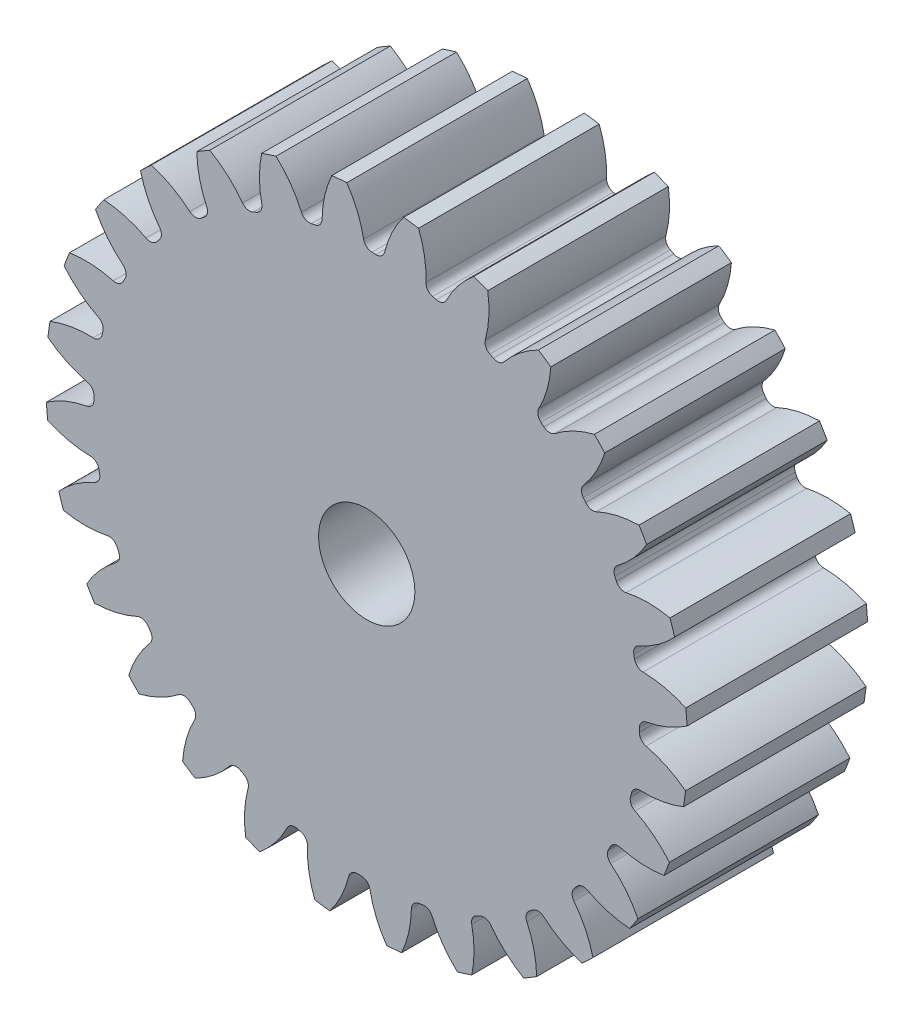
from build123d import *

# Parameters (mm, degrees)
SKETCH3_R         = 169.333333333
GEARBODY_DEPTH    = 95.25
TOOTHCUT_DEPTH    = 258.721008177
CIRPATTERN1_COUNT = 28
BOREDIA_R         = 25.4
BORE_DEPTH        = 12700


with BuildPart() as part:
    # Sketch3 → gearBody (new body)
    with BuildSketch(Plane.XY):
        Circle(SKETCH3_R)
    extrude(amount=GEARBODY_DEPTH)

    # Sketch2 → toothCut (cut, through all)
    with BuildSketch(Plane.XY):
        with BuildLine():
            ThreePointArc((143.851391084, -4.856102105), (143.882581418, -3.821937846), (143.906337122, -2.787576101))
            ThreePointArc((143.906337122, -2.787576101), (144.990758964, 0.089076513), (147.646306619, 1.638001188))
            ThreePointArc((147.646306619, 1.638001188), (158.972275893, 5.047162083), (169.333333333, 10.752286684))
            ThreePointArc((169.333333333, 10.752286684), (169.614534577, -4.505453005), (168.523721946, -19.726748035))
            ThreePointArc((168.523721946, -19.726748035), (158.480151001, -13.479617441), (147.351140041, -9.473987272))
            ThreePointArc((147.351140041, -9.473987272), (144.781567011, -7.786268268), (143.851391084, -4.856102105))
        make_face()
    toothcut = extrude(amount=TOOTHCUT_DEPTH, mode=Mode.SUBTRACT)

    # CirPattern1: toothCut ×28 about axis
    cirpattern1_axis = Axis((0, 0, 0), (0, 0, 1))
    for i in range(1, CIRPATTERN1_COUNT):
        add(toothcut.rotate(cirpattern1_axis, i * 360 / CIRPATTERN1_COUNT), mode=Mode.SUBTRACT)

    # boreDia → bore (cut, symmetric)
    with BuildSketch(Plane.XY):
        Circle(BOREDIA_R)
    extrude(amount=BORE_DEPTH, both=True, mode=Mode.SUBTRACT)


solid = part.part
